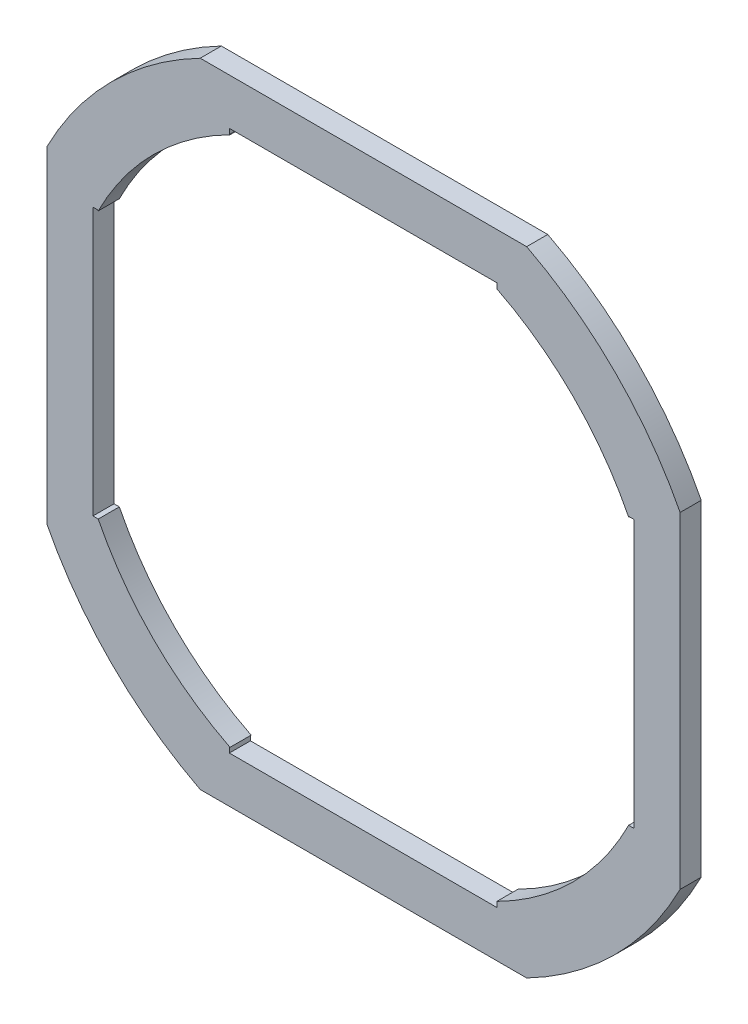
ISO-10303-21;
HEADER;
FILE_DESCRIPTION(('STEP AP214'),'2;1');
FILE_NAME('part.step','',(''),(''),'','','');
FILE_SCHEMA(('AUTOMOTIVE_DESIGN { 1 0 10303 214 1 1 1 1 }'));
ENDSEC;
DATA;
#1=APPLICATION_CONTEXT('core data for automotive mechanical design processes');
#2=APPLICATION_PROTOCOL_DEFINITION('international standard','automotive_design',2000,#1);
#3=PRODUCT_CONTEXT('',#1,'mechanical');
#4=PRODUCT('Part','Part','',(#3));
#5=PRODUCT_RELATED_PRODUCT_CATEGORY('part','',(#4));
#6=PRODUCT_DEFINITION_FORMATION('','',#4);
#7=PRODUCT_DEFINITION_CONTEXT('part definition',#1,'design');
#8=PRODUCT_DEFINITION('design','',#6,#7);
#9=PRODUCT_DEFINITION_SHAPE('','',#8);
#10=(LENGTH_UNIT() NAMED_UNIT(*) SI_UNIT(.MILLI.,.METRE.));
#11=(NAMED_UNIT(*) PLANE_ANGLE_UNIT() SI_UNIT($,.RADIAN.));
#12=(NAMED_UNIT(*) SI_UNIT($,.STERADIAN.) SOLID_ANGLE_UNIT());
#13=UNCERTAINTY_MEASURE_WITH_UNIT(LENGTH_MEASURE(1.E-05),#10,'distance_accuracy_value','');
#14=(GEOMETRIC_REPRESENTATION_CONTEXT(3) GLOBAL_UNCERTAINTY_ASSIGNED_CONTEXT((#13)) GLOBAL_UNIT_ASSIGNED_CONTEXT((#10,
#11,#12)) REPRESENTATION_CONTEXT('',''));
#15=CARTESIAN_POINT('',(0.,0.,0.));
#16=DIRECTION('',(0.,0.,1.));
#17=DIRECTION('',(1.,0.,0.));
#18=AXIS2_PLACEMENT_3D('',#15,#16,#17);
#19=CARTESIAN_POINT('',(0.,0.,-0.8));
#20=DIRECTION('',(0.,0.,-1.));
#21=DIRECTION('',(-1.,0.,0.));
#22=AXIS2_PLACEMENT_3D('',#19,#20,#21);
#23=PLANE('',#22);
#24=DIRECTION('',(1.,0.,0.));
#25=VECTOR('',#24,1.);
#26=CARTESIAN_POINT('',(-5.081068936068,10.05,-0.8));
#27=LINE('',#26,#25);
#28=CARTESIAN_POINT('',(-5.081068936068,10.05,-0.8));
#29=VERTEX_POINT('',#28);
#30=CARTESIAN_POINT('',(-5.05568986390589,10.05,-0.8));
#31=VERTEX_POINT('',#30);
#32=EDGE_CURVE('E181',#29,#31,#27,.T.);
#33=ORIENTED_EDGE('',*,*,#32,.T.);
#34=CARTESIAN_POINT('',(0.,0.,-0.8));
#35=DIRECTION('',(0.,0.,1.));
#36=DIRECTION('',(1.,0.,0.));
#37=AXIS2_PLACEMENT_3D('',#34,#35,#36);
#38=CIRCLE('',#37,11.25);
#39=CARTESIAN_POINT('',(-10.05,5.05568986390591,-0.8));
#40=VERTEX_POINT('',#39);
#41=EDGE_CURVE('E307',#31,#40,#38,.T.);
#42=ORIENTED_EDGE('',*,*,#41,.T.);
#43=DIRECTION('',(0.,1.,0.));
#44=VECTOR('',#43,1.);
#45=CARTESIAN_POINT('',(-10.05,0.,-0.8));
#46=LINE('',#45,#44);
#47=CARTESIAN_POINT('',(-10.05,5.081068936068,-0.8));
#48=VERTEX_POINT('',#47);
#49=EDGE_CURVE('E161',#40,#48,#46,.T.);
#50=ORIENTED_EDGE('',*,*,#49,.T.);
#51=DIRECTION('',(1.,0.,0.));
#52=VECTOR('',#51,1.);
#53=CARTESIAN_POINT('',(-10.25,5.081068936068,-0.8));
#54=LINE('',#53,#52);
#55=CARTESIAN_POINT('',(-10.25,5.081068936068,-0.8));
#56=VERTEX_POINT('',#55);
#57=EDGE_CURVE('E170',#56,#48,#54,.T.);
#58=ORIENTED_EDGE('',*,*,#57,.F.);
#59=DIRECTION('',(0.,1.,0.));
#60=VECTOR('',#59,1.);
#61=CARTESIAN_POINT('',(-10.25,-5.055689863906,-0.8));
#62=LINE('',#61,#60);
#63=CARTESIAN_POINT('',(-10.25,-5.055689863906,-0.8));
#64=VERTEX_POINT('',#63);
#65=EDGE_CURVE('E173',#64,#56,#62,.T.);
#66=ORIENTED_EDGE('',*,*,#65,.F.);
#67=DIRECTION('',(1.,0.,0.));
#68=VECTOR('',#67,1.);
#69=CARTESIAN_POINT('',(-10.05,-5.055689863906,-0.8));
#70=LINE('',#69,#68);
#71=CARTESIAN_POINT('',(-10.0499999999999,-5.05568986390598,-0.8));
#72=VERTEX_POINT('',#71);
#73=EDGE_CURVE('E254',#72,#64,#70,.F.);
#74=ORIENTED_EDGE('',*,*,#73,.F.);
#75=CARTESIAN_POINT('',(0.,0.,-0.8));
#76=DIRECTION('',(0.,0.,1.));
#77=DIRECTION('',(1.,0.,0.));
#78=AXIS2_PLACEMENT_3D('',#75,#76,#77);
#79=CIRCLE('',#78,11.25);
#80=CARTESIAN_POINT('',(-5.05568986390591,-10.05,-0.8));
#81=VERTEX_POINT('',#80);
#82=EDGE_CURVE('E316',#72,#81,#79,.T.);
#83=ORIENTED_EDGE('',*,*,#82,.T.);
#84=DIRECTION('',(1.,0.,0.));
#85=VECTOR('',#84,1.);
#86=CARTESIAN_POINT('',(-5.081068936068,-10.05,-0.8));
#87=LINE('',#86,#85);
#88=CARTESIAN_POINT('',(-5.081068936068,-10.05,-0.8));
#89=VERTEX_POINT('',#88);
#90=EDGE_CURVE('E249',#89,#81,#87,.T.);
#91=ORIENTED_EDGE('',*,*,#90,.F.);
#92=DIRECTION('',(0.,1.,0.));
#93=VECTOR('',#92,1.);
#94=CARTESIAN_POINT('',(-5.081068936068,-10.25,-0.8));
#95=LINE('',#94,#93);
#96=CARTESIAN_POINT('',(-5.081068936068,-10.25,-0.8));
#97=VERTEX_POINT('',#96);
#98=EDGE_CURVE('E243',#97,#89,#95,.T.);
#99=ORIENTED_EDGE('',*,*,#98,.F.);
#100=DIRECTION('',(1.,0.,0.));
#101=VECTOR('',#100,1.);
#102=CARTESIAN_POINT('',(5.055689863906,-10.25,-0.8));
#103=LINE('',#102,#101);
#104=CARTESIAN_POINT('',(5.055689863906,-10.25,-0.8));
#105=VERTEX_POINT('',#104);
#106=EDGE_CURVE('E237',#105,#97,#103,.F.);
#107=ORIENTED_EDGE('',*,*,#106,.F.);
#108=DIRECTION('',(0.,1.,0.));
#109=VECTOR('',#108,1.);
#110=CARTESIAN_POINT('',(5.055689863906,-10.05,-0.8));
#111=LINE('',#110,#109);
#112=CARTESIAN_POINT('',(5.05568986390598,-10.0499999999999,-0.8));
#113=VERTEX_POINT('',#112);
#114=EDGE_CURVE('E230',#113,#105,#111,.F.);
#115=ORIENTED_EDGE('',*,*,#114,.F.);
#116=CARTESIAN_POINT('',(0.,0.,-0.8));
#117=DIRECTION('',(0.,0.,1.));
#118=DIRECTION('',(1.,0.,0.));
#119=AXIS2_PLACEMENT_3D('',#116,#117,#118);
#120=CIRCLE('',#119,11.25);
#121=CARTESIAN_POINT('',(10.05,-5.055689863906,-0.8));
#122=VERTEX_POINT('',#121);
#123=EDGE_CURVE('E313',#113,#122,#120,.T.);
#124=ORIENTED_EDGE('',*,*,#123,.T.);
#125=DIRECTION('',(1.,0.,0.));
#126=VECTOR('',#125,1.);
#127=CARTESIAN_POINT('',(10.05,-5.055689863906,-0.8));
#128=LINE('',#127,#126);
#129=CARTESIAN_POINT('',(10.25,-5.055689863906,-0.8));
#130=VERTEX_POINT('',#129);
#131=EDGE_CURVE('E224',#122,#130,#128,.T.);
#132=ORIENTED_EDGE('',*,*,#131,.T.);
#133=DIRECTION('',(0.,1.,0.));
#134=VECTOR('',#133,1.);
#135=CARTESIAN_POINT('',(10.25,-5.055689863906,-0.8));
#136=LINE('',#135,#134);
#137=CARTESIAN_POINT('',(10.25,5.081068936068,-0.8));
#138=VERTEX_POINT('',#137);
#139=EDGE_CURVE('E218',#130,#138,#136,.T.);
#140=ORIENTED_EDGE('',*,*,#139,.T.);
#141=DIRECTION('',(1.,0.,0.));
#142=VECTOR('',#141,1.);
#143=CARTESIAN_POINT('',(10.25,5.081068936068,-0.8));
#144=LINE('',#143,#142);
#145=CARTESIAN_POINT('',(10.05,5.081068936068,-0.8));
#146=VERTEX_POINT('',#145);
#147=EDGE_CURVE('E212',#138,#146,#144,.F.);
#148=ORIENTED_EDGE('',*,*,#147,.T.);
#149=DIRECTION('',(0.,1.,0.));
#150=VECTOR('',#149,1.);
#151=CARTESIAN_POINT('',(10.05,5.081068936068,-0.8));
#152=LINE('',#151,#150);
#153=CARTESIAN_POINT('',(10.05,5.05568986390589,-0.8));
#154=VERTEX_POINT('',#153);
#155=EDGE_CURVE('E205',#146,#154,#152,.F.);
#156=ORIENTED_EDGE('',*,*,#155,.T.);
#157=CARTESIAN_POINT('',(0.,0.,-0.8));
#158=DIRECTION('',(0.,0.,1.));
#159=DIRECTION('',(1.,0.,0.));
#160=AXIS2_PLACEMENT_3D('',#157,#158,#159);
#161=CIRCLE('',#160,11.25);
#162=CARTESIAN_POINT('',(5.055689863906,10.05,-0.8));
#163=VERTEX_POINT('',#162);
#164=EDGE_CURVE('E208',#154,#163,#161,.T.);
#165=ORIENTED_EDGE('',*,*,#164,.T.);
#166=DIRECTION('',(0.,1.,0.));
#167=VECTOR('',#166,1.);
#168=CARTESIAN_POINT('',(5.055689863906,10.05,-0.8));
#169=LINE('',#168,#167);
#170=CARTESIAN_POINT('',(5.055689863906,10.25,-0.8));
#171=VERTEX_POINT('',#170);
#172=EDGE_CURVE('E199',#163,#171,#169,.T.);
#173=ORIENTED_EDGE('',*,*,#172,.T.);
#174=DIRECTION('',(1.,0.,0.));
#175=VECTOR('',#174,1.);
#176=CARTESIAN_POINT('',(5.055689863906,10.25,-0.8));
#177=LINE('',#176,#175);
#178=CARTESIAN_POINT('',(-5.081068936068,10.25,-0.8));
#179=VERTEX_POINT('',#178);
#180=EDGE_CURVE('E193',#171,#179,#177,.F.);
#181=ORIENTED_EDGE('',*,*,#180,.T.);
#182=DIRECTION('',(0.,1.,0.));
#183=VECTOR('',#182,1.);
#184=CARTESIAN_POINT('',(-5.081068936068,10.25,-0.8));
#185=LINE('',#184,#183);
#186=EDGE_CURVE('E187',#179,#29,#185,.F.);
#187=ORIENTED_EDGE('',*,*,#186,.T.);
#188=EDGE_LOOP('',(#33,#42,#50,#58,#66,#74,#83,#91,#99,#107,#115,#124,#132,#140,#148,#156,#165,
#173,#181,#187));
#189=FACE_BOUND('',#188,.T.);
#190=DIRECTION('',(0.,1.,0.));
#191=VECTOR('',#190,1.);
#192=CARTESIAN_POINT('',(-12.,-6.184658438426,-0.8));
#193=LINE('',#192,#191);
#194=CARTESIAN_POINT('',(-12.,-6.18465843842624,-0.8));
#195=VERTEX_POINT('',#194);
#196=CARTESIAN_POINT('',(-12.0000000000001,6.18465843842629,-0.8));
#197=VERTEX_POINT('',#196);
#198=EDGE_CURVE('E268',#195,#197,#193,.T.);
#199=ORIENTED_EDGE('',*,*,#198,.T.);
#200=CARTESIAN_POINT('',(0.,0.,-0.8));
#201=DIRECTION('',(0.,0.,-1.));
#202=DIRECTION('',(-1.,0.,0.));
#203=AXIS2_PLACEMENT_3D('',#200,#201,#202);
#204=CIRCLE('',#203,13.5);
#205=CARTESIAN_POINT('',(-6.18465843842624,12.,-0.8));
#206=VERTEX_POINT('',#205);
#207=EDGE_CURVE('E270',#206,#197,#204,.F.);
#208=ORIENTED_EDGE('',*,*,#207,.F.);
#209=DIRECTION('',(1.,0.,0.));
#210=VECTOR('',#209,1.);
#211=CARTESIAN_POINT('',(-7.,12.,-0.8));
#212=LINE('',#211,#210);
#213=CARTESIAN_POINT('',(6.18465843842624,12.,-0.8));
#214=VERTEX_POINT('',#213);
#215=EDGE_CURVE('E157',#206,#214,#212,.T.);
#216=ORIENTED_EDGE('',*,*,#215,.T.);
#217=CARTESIAN_POINT('',(0.,0.,-0.8));
#218=DIRECTION('',(0.,0.,-1.));
#219=DIRECTION('',(-1.,0.,0.));
#220=AXIS2_PLACEMENT_3D('',#217,#218,#219);
#221=CIRCLE('',#220,13.5);
#222=CARTESIAN_POINT('',(12.,6.18465843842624,-0.8));
#223=VERTEX_POINT('',#222);
#224=EDGE_CURVE('E19',#223,#214,#221,.F.);
#225=ORIENTED_EDGE('',*,*,#224,.F.);
#226=DIRECTION('',(0.,1.,0.));
#227=VECTOR('',#226,1.);
#228=CARTESIAN_POINT('',(12.,7.,-0.8));
#229=LINE('',#228,#227);
#230=CARTESIAN_POINT('',(12.0000000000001,-6.18465843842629,-0.8));
#231=VERTEX_POINT('',#230);
#232=EDGE_CURVE('E141',#223,#231,#229,.F.);
#233=ORIENTED_EDGE('',*,*,#232,.T.);
#234=CARTESIAN_POINT('',(0.,0.,-0.8));
#235=DIRECTION('',(0.,0.,-1.));
#236=DIRECTION('',(-1.,0.,0.));
#237=AXIS2_PLACEMENT_3D('',#234,#235,#236);
#238=CIRCLE('',#237,13.5);
#239=CARTESIAN_POINT('',(6.18465843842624,-12.,-0.8));
#240=VERTEX_POINT('',#239);
#241=EDGE_CURVE('E166',#240,#231,#238,.F.);
#242=ORIENTED_EDGE('',*,*,#241,.F.);
#243=DIRECTION('',(1.,0.,0.));
#244=VECTOR('',#243,1.);
#245=CARTESIAN_POINT('',(7.,-12.,-0.8));
#246=LINE('',#245,#244);
#247=CARTESIAN_POINT('',(-6.18465843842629,-12.0000000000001,-0.8));
#248=VERTEX_POINT('',#247);
#249=EDGE_CURVE('E272',#240,#248,#246,.F.);
#250=ORIENTED_EDGE('',*,*,#249,.T.);
#251=CARTESIAN_POINT('',(0.,0.,-0.8));
#252=DIRECTION('',(0.,0.,-1.));
#253=DIRECTION('',(-1.,0.,0.));
#254=AXIS2_PLACEMENT_3D('',#251,#252,#253);
#255=CIRCLE('',#254,13.5);
#256=EDGE_CURVE('E320',#195,#248,#255,.F.);
#257=ORIENTED_EDGE('',*,*,#256,.F.);
#258=EDGE_LOOP('',(#199,#208,#216,#225,#233,#242,#250,#257));
#259=FACE_BOUND('',#258,.T.);
#260=ADVANCED_FACE('F16',(#189,#259),#23,.T.);
#261=CARTESIAN_POINT('',(0.,0.,0.));
#262=DIRECTION('',(0.,0.,-1.));
#263=DIRECTION('',(-1.,0.,0.));
#264=AXIS2_PLACEMENT_3D('',#261,#262,#263);
#265=CYLINDRICAL_SURFACE('',#264,13.5);
#266=DIRECTION('',(0.,0.,1.));
#267=VECTOR('',#266,1.);
#268=CARTESIAN_POINT('',(12.,6.184658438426,0.));
#269=LINE('',#268,#267);
#270=CARTESIAN_POINT('',(12.,6.18465843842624,0.));
#271=VERTEX_POINT('',#270);
#272=EDGE_CURVE('E146',#271,#223,#269,.F.);
#273=ORIENTED_EDGE('',*,*,#272,.T.);
#274=ORIENTED_EDGE('',*,*,#224,.T.);
#275=DIRECTION('',(0.,0.,-1.));
#276=VECTOR('',#275,1.);
#277=CARTESIAN_POINT('',(6.184658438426,12.,0.));
#278=LINE('',#277,#276);
#279=CARTESIAN_POINT('',(6.18465843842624,12.,0.));
#280=VERTEX_POINT('',#279);
#281=EDGE_CURVE('E266',#214,#280,#278,.F.);
#282=ORIENTED_EDGE('',*,*,#281,.T.);
#283=CARTESIAN_POINT('',(0.,0.,0.));
#284=DIRECTION('',(0.,0.,-1.));
#285=DIRECTION('',(-1.,0.,0.));
#286=AXIS2_PLACEMENT_3D('',#283,#284,#285);
#287=CIRCLE('',#286,13.5);
#288=EDGE_CURVE('E164',#280,#271,#287,.T.);
#289=ORIENTED_EDGE('',*,*,#288,.T.);
#290=EDGE_LOOP('',(#273,#274,#282,#289));
#291=FACE_BOUND('',#290,.T.);
#292=ADVANCED_FACE('F163',(#291),#265,.T.);
#293=CARTESIAN_POINT('',(12.,7.,0.));
#294=DIRECTION('',(-1.,0.,0.));
#295=DIRECTION('',(0.,0.,1.));
#296=AXIS2_PLACEMENT_3D('',#293,#294,#295);
#297=PLANE('',#296);
#298=DIRECTION('',(0.,1.,0.));
#299=VECTOR('',#298,1.);
#300=CARTESIAN_POINT('',(12.,0.,0.));
#301=LINE('',#300,#299);
#302=CARTESIAN_POINT('',(12.0000000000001,-6.18465843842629,0.));
#303=VERTEX_POINT('',#302);
#304=EDGE_CURVE('E305',#271,#303,#301,.F.);
#305=ORIENTED_EDGE('',*,*,#304,.T.);
#306=DIRECTION('',(0.,0.,-1.));
#307=VECTOR('',#306,1.);
#308=CARTESIAN_POINT('',(12.0000000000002,-6.1846584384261,0.));
#309=LINE('',#308,#307);
#310=EDGE_CURVE('E148',#231,#303,#309,.F.);
#311=ORIENTED_EDGE('',*,*,#310,.F.);
#312=ORIENTED_EDGE('',*,*,#232,.F.);
#313=ORIENTED_EDGE('',*,*,#272,.F.);
#314=EDGE_LOOP('',(#305,#311,#312,#313));
#315=FACE_BOUND('',#314,.T.);
#316=ADVANCED_FACE('F144',(#315),#297,.F.);
#317=CARTESIAN_POINT('',(0.,0.,0.));
#318=DIRECTION('',(0.,0.,-1.));
#319=DIRECTION('',(-1.,0.,0.));
#320=AXIS2_PLACEMENT_3D('',#317,#318,#319);
#321=CYLINDRICAL_SURFACE('',#320,13.5);
#322=DIRECTION('',(0.,0.,1.));
#323=VECTOR('',#322,1.);
#324=CARTESIAN_POINT('',(6.184658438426,-12.,0.));
#325=LINE('',#324,#323);
#326=CARTESIAN_POINT('',(6.18465843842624,-12.,0.));
#327=VERTEX_POINT('',#326);
#328=EDGE_CURVE('E273',#327,#240,#325,.F.);
#329=ORIENTED_EDGE('',*,*,#328,.T.);
#330=ORIENTED_EDGE('',*,*,#241,.T.);
#331=ORIENTED_EDGE('',*,*,#310,.T.);
#332=CARTESIAN_POINT('',(0.,0.,0.));
#333=DIRECTION('',(0.,0.,-1.));
#334=DIRECTION('',(-1.,0.,0.));
#335=AXIS2_PLACEMENT_3D('',#332,#333,#334);
#336=CIRCLE('',#335,13.5);
#337=EDGE_CURVE('E302',#303,#327,#336,.T.);
#338=ORIENTED_EDGE('',*,*,#337,.T.);
#339=EDGE_LOOP('',(#329,#330,#331,#338));
#340=FACE_BOUND('',#339,.T.);
#341=ADVANCED_FACE('F325',(#340),#321,.T.);
#342=CARTESIAN_POINT('',(7.,-12.,0.));
#343=DIRECTION('',(0.,1.,0.));
#344=DIRECTION('',(0.,0.,1.));
#345=AXIS2_PLACEMENT_3D('',#342,#343,#344);
#346=PLANE('',#345);
#347=DIRECTION('',(-1.,0.,0.));
#348=VECTOR('',#347,1.);
#349=CARTESIAN_POINT('',(0.,-12.,0.));
#350=LINE('',#349,#348);
#351=CARTESIAN_POINT('',(-6.18465843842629,-12.0000000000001,0.));
#352=VERTEX_POINT('',#351);
#353=EDGE_CURVE('E301',#327,#352,#350,.T.);
#354=ORIENTED_EDGE('',*,*,#353,.T.);
#355=DIRECTION('',(0.,0.,-1.));
#356=VECTOR('',#355,1.);
#357=CARTESIAN_POINT('',(-6.1846584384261,-12.0000000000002,0.));
#358=LINE('',#357,#356);
#359=EDGE_CURVE('E322',#248,#352,#358,.F.);
#360=ORIENTED_EDGE('',*,*,#359,.F.);
#361=ORIENTED_EDGE('',*,*,#249,.F.);
#362=ORIENTED_EDGE('',*,*,#328,.F.);
#363=EDGE_LOOP('',(#354,#360,#361,#362));
#364=FACE_BOUND('',#363,.T.);
#365=ADVANCED_FACE('F335',(#364),#346,.F.);
#366=CARTESIAN_POINT('',(0.,0.,0.));
#367=DIRECTION('',(0.,0.,-1.));
#368=DIRECTION('',(-1.,0.,0.));
#369=AXIS2_PLACEMENT_3D('',#366,#367,#368);
#370=CYLINDRICAL_SURFACE('',#369,13.5);
#371=DIRECTION('',(0.,0.,-1.));
#372=VECTOR('',#371,1.);
#373=CARTESIAN_POINT('',(-12.,-6.184658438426,0.));
#374=LINE('',#373,#372);
#375=CARTESIAN_POINT('',(-12.,-6.18465843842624,0.));
#376=VERTEX_POINT('',#375);
#377=EDGE_CURVE('E271',#376,#195,#374,.T.);
#378=ORIENTED_EDGE('',*,*,#377,.T.);
#379=ORIENTED_EDGE('',*,*,#256,.T.);
#380=ORIENTED_EDGE('',*,*,#359,.T.);
#381=CARTESIAN_POINT('',(0.,0.,0.));
#382=DIRECTION('',(0.,0.,-1.));
#383=DIRECTION('',(-1.,0.,0.));
#384=AXIS2_PLACEMENT_3D('',#381,#382,#383);
#385=CIRCLE('',#384,13.5);
#386=EDGE_CURVE('E298',#352,#376,#385,.T.);
#387=ORIENTED_EDGE('',*,*,#386,.T.);
#388=EDGE_LOOP('',(#378,#379,#380,#387));
#389=FACE_BOUND('',#388,.T.);
#390=ADVANCED_FACE('F332',(#389),#370,.T.);
#391=CARTESIAN_POINT('',(-12.,-6.184658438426,0.));
#392=DIRECTION('',(1.,0.,0.));
#393=DIRECTION('',(0.,0.,-1.));
#394=AXIS2_PLACEMENT_3D('',#391,#392,#393);
#395=PLANE('',#394);
#396=ORIENTED_EDGE('',*,*,#377,.F.);
#397=DIRECTION('',(0.,1.,0.));
#398=VECTOR('',#397,1.);
#399=CARTESIAN_POINT('',(-12.,0.,0.));
#400=LINE('',#399,#398);
#401=CARTESIAN_POINT('',(-12.0000000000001,6.18465843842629,0.));
#402=VERTEX_POINT('',#401);
#403=EDGE_CURVE('E297',#376,#402,#400,.T.);
#404=ORIENTED_EDGE('',*,*,#403,.T.);
#405=DIRECTION('',(0.,0.,-1.));
#406=VECTOR('',#405,1.);
#407=CARTESIAN_POINT('',(-12.0000000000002,6.1846584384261,0.));
#408=LINE('',#407,#406);
#409=EDGE_CURVE('E267',#197,#402,#408,.F.);
#410=ORIENTED_EDGE('',*,*,#409,.F.);
#411=ORIENTED_EDGE('',*,*,#198,.F.);
#412=EDGE_LOOP('',(#396,#404,#410,#411));
#413=FACE_BOUND('',#412,.T.);
#414=ADVANCED_FACE('F721',(#413),#395,.F.);
#415=CARTESIAN_POINT('',(0.,0.,0.));
#416=DIRECTION('',(0.,0.,-1.));
#417=DIRECTION('',(-1.,0.,0.));
#418=AXIS2_PLACEMENT_3D('',#415,#416,#417);
#419=CYLINDRICAL_SURFACE('',#418,13.5);
#420=ORIENTED_EDGE('',*,*,#409,.T.);
#421=CARTESIAN_POINT('',(0.,0.,0.));
#422=DIRECTION('',(0.,0.,-1.));
#423=DIRECTION('',(-1.,0.,0.));
#424=AXIS2_PLACEMENT_3D('',#421,#422,#423);
#425=CIRCLE('',#424,13.5);
#426=CARTESIAN_POINT('',(-6.18465843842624,12.,0.));
#427=VERTEX_POINT('',#426);
#428=EDGE_CURVE('E293',#402,#427,#425,.T.);
#429=ORIENTED_EDGE('',*,*,#428,.T.);
#430=DIRECTION('',(0.,0.,-1.));
#431=VECTOR('',#430,1.);
#432=CARTESIAN_POINT('',(-6.184658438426,12.,0.));
#433=LINE('',#432,#431);
#434=EDGE_CURVE('E174',#427,#206,#433,.T.);
#435=ORIENTED_EDGE('',*,*,#434,.T.);
#436=ORIENTED_EDGE('',*,*,#207,.T.);
#437=EDGE_LOOP('',(#420,#429,#435,#436));
#438=FACE_BOUND('',#437,.T.);
#439=ADVANCED_FACE('F713',(#438),#419,.T.);
#440=CARTESIAN_POINT('',(-7.,12.,0.));
#441=DIRECTION('',(0.,-1.,0.));
#442=DIRECTION('',(0.,0.,-1.));
#443=AXIS2_PLACEMENT_3D('',#440,#441,#442);
#444=PLANE('',#443);
#445=DIRECTION('',(-1.,0.,0.));
#446=VECTOR('',#445,1.);
#447=CARTESIAN_POINT('',(0.,12.,0.));
#448=LINE('',#447,#446);
#449=EDGE_CURVE('E296',#427,#280,#448,.F.);
#450=ORIENTED_EDGE('',*,*,#449,.T.);
#451=ORIENTED_EDGE('',*,*,#281,.F.);
#452=ORIENTED_EDGE('',*,*,#215,.F.);
#453=ORIENTED_EDGE('',*,*,#434,.F.);
#454=EDGE_LOOP('',(#450,#451,#452,#453));
#455=FACE_BOUND('',#454,.T.);
#456=ADVANCED_FACE('F706',(#455),#444,.F.);
#457=CARTESIAN_POINT('',(-10.25,5.081068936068,0.));
#458=DIRECTION('',(0.,-1.,0.));
#459=DIRECTION('',(0.,0.,-1.));
#460=AXIS2_PLACEMENT_3D('',#457,#458,#459);
#461=PLANE('',#460);
#462=ORIENTED_EDGE('',*,*,#57,.T.);
#463=DIRECTION('',(0.,0.,1.));
#464=VECTOR('',#463,1.);
#465=CARTESIAN_POINT('',(-10.05,5.081068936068,0.));
#466=LINE('',#465,#464);
#467=CARTESIAN_POINT('',(-10.05,5.081068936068,0.));
#468=VERTEX_POINT('',#467);
#469=EDGE_CURVE('E310',#468,#48,#466,.F.);
#470=ORIENTED_EDGE('',*,*,#469,.F.);
#471=DIRECTION('',(-1.,0.,0.));
#472=VECTOR('',#471,1.);
#473=CARTESIAN_POINT('',(0.,5.081068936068,0.));
#474=LINE('',#473,#472);
#475=CARTESIAN_POINT('',(-10.25,5.081068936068,0.));
#476=VERTEX_POINT('',#475);
#477=EDGE_CURVE('E353',#468,#476,#474,.T.);
#478=ORIENTED_EDGE('',*,*,#477,.T.);
#479=DIRECTION('',(0.,0.,-1.));
#480=VECTOR('',#479,1.);
#481=CARTESIAN_POINT('',(-10.25,5.081068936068,0.));
#482=LINE('',#481,#480);
#483=EDGE_CURVE('E258',#56,#476,#482,.F.);
#484=ORIENTED_EDGE('',*,*,#483,.F.);
#485=EDGE_LOOP('',(#462,#470,#478,#484));
#486=FACE_BOUND('',#485,.T.);
#487=ADVANCED_FACE('F540',(#486),#461,.T.);
#488=CARTESIAN_POINT('',(-10.25,-5.055689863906,0.));
#489=DIRECTION('',(1.,0.,0.));
#490=DIRECTION('',(0.,0.,-1.));
#491=AXIS2_PLACEMENT_3D('',#488,#489,#490);
#492=PLANE('',#491);
#493=ORIENTED_EDGE('',*,*,#65,.T.);
#494=ORIENTED_EDGE('',*,*,#483,.T.);
#495=DIRECTION('',(0.,1.,0.));
#496=VECTOR('',#495,1.);
#497=CARTESIAN_POINT('',(-10.25,0.,0.));
#498=LINE('',#497,#496);
#499=CARTESIAN_POINT('',(-10.25,-5.055689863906,0.));
#500=VERTEX_POINT('',#499);
#501=EDGE_CURVE('E350',#476,#500,#498,.F.);
#502=ORIENTED_EDGE('',*,*,#501,.T.);
#503=DIRECTION('',(0.,0.,1.));
#504=VECTOR('',#503,1.);
#505=CARTESIAN_POINT('',(-10.25,-5.055689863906,0.));
#506=LINE('',#505,#504);
#507=EDGE_CURVE('E257',#64,#500,#506,.T.);
#508=ORIENTED_EDGE('',*,*,#507,.F.);
#509=EDGE_LOOP('',(#493,#494,#502,#508));
#510=FACE_BOUND('',#509,.T.);
#511=ADVANCED_FACE('F691',(#510),#492,.T.);
#512=CARTESIAN_POINT('',(-10.05,-5.055689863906,0.));
#513=DIRECTION('',(0.,1.,0.));
#514=DIRECTION('',(0.,0.,1.));
#515=AXIS2_PLACEMENT_3D('',#512,#513,#514);
#516=PLANE('',#515);
#517=ORIENTED_EDGE('',*,*,#73,.T.);
#518=ORIENTED_EDGE('',*,*,#507,.T.);
#519=DIRECTION('',(-1.,0.,0.));
#520=VECTOR('',#519,1.);
#521=CARTESIAN_POINT('',(0.,-5.055689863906,0.));
#522=LINE('',#521,#520);
#523=CARTESIAN_POINT('',(-10.0499999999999,-5.05568986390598,0.));
#524=VERTEX_POINT('',#523);
#525=EDGE_CURVE('E292',#500,#524,#522,.F.);
#526=ORIENTED_EDGE('',*,*,#525,.T.);
#527=DIRECTION('',(0.,0.,1.));
#528=VECTOR('',#527,1.);
#529=CARTESIAN_POINT('',(-10.0499999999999,-5.05568986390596,0.));
#530=LINE('',#529,#528);
#531=EDGE_CURVE('E251',#524,#72,#530,.F.);
#532=ORIENTED_EDGE('',*,*,#531,.T.);
#533=EDGE_LOOP('',(#517,#518,#526,#532));
#534=FACE_BOUND('',#533,.T.);
#535=ADVANCED_FACE('F683',(#534),#516,.T.);
#536=CARTESIAN_POINT('',(0.,0.,0.));
#537=DIRECTION('',(0.,0.,1.));
#538=DIRECTION('',(1.,0.,0.));
#539=AXIS2_PLACEMENT_3D('',#536,#537,#538);
#540=CYLINDRICAL_SURFACE('',#539,11.25);
#541=CARTESIAN_POINT('',(0.,0.,0.));
#542=DIRECTION('',(0.,0.,1.));
#543=DIRECTION('',(1.,0.,0.));
#544=AXIS2_PLACEMENT_3D('',#541,#542,#543);
#545=CIRCLE('',#544,11.25);
#546=CARTESIAN_POINT('',(-5.05568986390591,-10.05,0.));
#547=VERTEX_POINT('',#546);
#548=EDGE_CURVE('E288',#524,#547,#545,.T.);
#549=ORIENTED_EDGE('',*,*,#548,.T.);
#550=DIRECTION('',(0.,0.,-1.));
#551=VECTOR('',#550,1.);
#552=CARTESIAN_POINT('',(-5.055689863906,-10.05,0.));
#553=LINE('',#552,#551);
#554=EDGE_CURVE('E246',#81,#547,#553,.F.);
#555=ORIENTED_EDGE('',*,*,#554,.F.);
#556=ORIENTED_EDGE('',*,*,#82,.F.);
#557=ORIENTED_EDGE('',*,*,#531,.F.);
#558=EDGE_LOOP('',(#549,#555,#556,#557));
#559=FACE_BOUND('',#558,.T.);
#560=ADVANCED_FACE('F675',(#559),#540,.F.);
#561=CARTESIAN_POINT('',(-5.081068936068,-10.05,0.));
#562=DIRECTION('',(0.,-1.,0.));
#563=DIRECTION('',(0.,0.,-1.));
#564=AXIS2_PLACEMENT_3D('',#561,#562,#563);
#565=PLANE('',#564);
#566=ORIENTED_EDGE('',*,*,#90,.T.);
#567=ORIENTED_EDGE('',*,*,#554,.T.);
#568=DIRECTION('',(-1.,0.,0.));
#569=VECTOR('',#568,1.);
#570=CARTESIAN_POINT('',(0.,-10.05,0.));
#571=LINE('',#570,#569);
#572=CARTESIAN_POINT('',(-5.081068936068,-10.05,0.));
#573=VERTEX_POINT('',#572);
#574=EDGE_CURVE('E291',#547,#573,#571,.T.);
#575=ORIENTED_EDGE('',*,*,#574,.T.);
#576=DIRECTION('',(0.,0.,-1.));
#577=VECTOR('',#576,1.);
#578=CARTESIAN_POINT('',(-5.081068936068,-10.05,0.));
#579=LINE('',#578,#577);
#580=EDGE_CURVE('E240',#89,#573,#579,.F.);
#581=ORIENTED_EDGE('',*,*,#580,.F.);
#582=EDGE_LOOP('',(#566,#567,#575,#581));
#583=FACE_BOUND('',#582,.T.);
#584=ADVANCED_FACE('F667',(#583),#565,.T.);
#585=CARTESIAN_POINT('',(-5.081068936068,-10.25,0.));
#586=DIRECTION('',(1.,0.,0.));
#587=DIRECTION('',(0.,0.,-1.));
#588=AXIS2_PLACEMENT_3D('',#585,#586,#587);
#589=PLANE('',#588);
#590=ORIENTED_EDGE('',*,*,#98,.T.);
#591=ORIENTED_EDGE('',*,*,#580,.T.);
#592=DIRECTION('',(0.,1.,0.));
#593=VECTOR('',#592,1.);
#594=CARTESIAN_POINT('',(-5.081068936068,0.,0.));
#595=LINE('',#594,#593);
#596=CARTESIAN_POINT('',(-5.081068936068,-10.25,0.));
#597=VERTEX_POINT('',#596);
#598=EDGE_CURVE('E367',#573,#597,#595,.F.);
#599=ORIENTED_EDGE('',*,*,#598,.T.);
#600=DIRECTION('',(0.,0.,1.));
#601=VECTOR('',#600,1.);
#602=CARTESIAN_POINT('',(-5.081068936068,-10.25,0.));
#603=LINE('',#602,#601);
#604=EDGE_CURVE('E234',#97,#597,#603,.T.);
#605=ORIENTED_EDGE('',*,*,#604,.F.);
#606=EDGE_LOOP('',(#590,#591,#599,#605));
#607=FACE_BOUND('',#606,.T.);
#608=ADVANCED_FACE('F659',(#607),#589,.T.);
#609=CARTESIAN_POINT('',(5.055689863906,-10.25,0.));
#610=DIRECTION('',(0.,1.,0.));
#611=DIRECTION('',(0.,0.,1.));
#612=AXIS2_PLACEMENT_3D('',#609,#610,#611);
#613=PLANE('',#612);
#614=ORIENTED_EDGE('',*,*,#106,.T.);
#615=ORIENTED_EDGE('',*,*,#604,.T.);
#616=DIRECTION('',(-1.,0.,0.));
#617=VECTOR('',#616,1.);
#618=CARTESIAN_POINT('',(0.,-10.25,0.));
#619=LINE('',#618,#617);
#620=CARTESIAN_POINT('',(5.055689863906,-10.25,0.));
#621=VERTEX_POINT('',#620);
#622=EDGE_CURVE('E370',#597,#621,#619,.F.);
#623=ORIENTED_EDGE('',*,*,#622,.T.);
#624=DIRECTION('',(0.,0.,1.));
#625=VECTOR('',#624,1.);
#626=CARTESIAN_POINT('',(5.055689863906,-10.25,0.));
#627=LINE('',#626,#625);
#628=EDGE_CURVE('E233',#105,#621,#627,.T.);
#629=ORIENTED_EDGE('',*,*,#628,.F.);
#630=EDGE_LOOP('',(#614,#615,#623,#629));
#631=FACE_BOUND('',#630,.T.);
#632=ADVANCED_FACE('F651',(#631),#613,.T.);
#633=CARTESIAN_POINT('',(5.055689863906,-10.05,0.));
#634=DIRECTION('',(-1.,0.,0.));
#635=DIRECTION('',(0.,0.,1.));
#636=AXIS2_PLACEMENT_3D('',#633,#634,#635);
#637=PLANE('',#636);
#638=ORIENTED_EDGE('',*,*,#114,.T.);
#639=ORIENTED_EDGE('',*,*,#628,.T.);
#640=DIRECTION('',(0.,1.,0.));
#641=VECTOR('',#640,1.);
#642=CARTESIAN_POINT('',(5.055689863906,0.,0.));
#643=LINE('',#642,#641);
#644=CARTESIAN_POINT('',(5.05568986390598,-10.0499999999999,0.));
#645=VERTEX_POINT('',#644);
#646=EDGE_CURVE('E287',#621,#645,#643,.T.);
#647=ORIENTED_EDGE('',*,*,#646,.T.);
#648=DIRECTION('',(0.,0.,1.));
#649=VECTOR('',#648,1.);
#650=CARTESIAN_POINT('',(5.05568986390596,-10.0499999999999,0.));
#651=LINE('',#650,#649);
#652=EDGE_CURVE('E315',#645,#113,#651,.F.);
#653=ORIENTED_EDGE('',*,*,#652,.T.);
#654=EDGE_LOOP('',(#638,#639,#647,#653));
#655=FACE_BOUND('',#654,.T.);
#656=ADVANCED_FACE('F643',(#655),#637,.T.);
#657=CARTESIAN_POINT('',(0.,0.,0.));
#658=DIRECTION('',(0.,0.,1.));
#659=DIRECTION('',(1.,0.,0.));
#660=AXIS2_PLACEMENT_3D('',#657,#658,#659);
#661=CYLINDRICAL_SURFACE('',#660,11.25);
#662=ORIENTED_EDGE('',*,*,#123,.F.);
#663=ORIENTED_EDGE('',*,*,#652,.F.);
#664=CARTESIAN_POINT('',(0.,0.,0.));
#665=DIRECTION('',(0.,0.,1.));
#666=DIRECTION('',(1.,0.,0.));
#667=AXIS2_PLACEMENT_3D('',#664,#665,#666);
#668=CIRCLE('',#667,11.25);
#669=CARTESIAN_POINT('',(10.05,-5.055689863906,0.));
#670=VERTEX_POINT('',#669);
#671=EDGE_CURVE('E283',#645,#670,#668,.T.);
#672=ORIENTED_EDGE('',*,*,#671,.T.);
#673=DIRECTION('',(0.,0.,-1.));
#674=VECTOR('',#673,1.);
#675=CARTESIAN_POINT('',(10.05,-5.055689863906,0.));
#676=LINE('',#675,#674);
#677=EDGE_CURVE('E227',#670,#122,#676,.T.);
#678=ORIENTED_EDGE('',*,*,#677,.T.);
#679=EDGE_LOOP('',(#662,#663,#672,#678));
#680=FACE_BOUND('',#679,.T.);
#681=ADVANCED_FACE('F635',(#680),#661,.F.);
#682=CARTESIAN_POINT('',(10.05,-5.055689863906,0.));
#683=DIRECTION('',(0.,-1.,0.));
#684=DIRECTION('',(0.,0.,-1.));
#685=AXIS2_PLACEMENT_3D('',#682,#683,#684);
#686=PLANE('',#685);
#687=DIRECTION('',(0.,0.,-1.));
#688=VECTOR('',#687,1.);
#689=CARTESIAN_POINT('',(10.25,-5.055689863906,0.));
#690=LINE('',#689,#688);
#691=CARTESIAN_POINT('',(10.25,-5.055689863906,0.));
#692=VERTEX_POINT('',#691);
#693=EDGE_CURVE('E221',#692,#130,#690,.T.);
#694=ORIENTED_EDGE('',*,*,#693,.T.);
#695=ORIENTED_EDGE('',*,*,#131,.F.);
#696=ORIENTED_EDGE('',*,*,#677,.F.);
#697=DIRECTION('',(-1.,0.,0.));
#698=VECTOR('',#697,1.);
#699=CARTESIAN_POINT('',(0.,-5.055689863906,0.));
#700=LINE('',#699,#698);
#701=EDGE_CURVE('E286',#670,#692,#700,.F.);
#702=ORIENTED_EDGE('',*,*,#701,.T.);
#703=EDGE_LOOP('',(#694,#695,#696,#702));
#704=FACE_BOUND('',#703,.T.);
#705=ADVANCED_FACE('F627',(#704),#686,.F.);
#706=CARTESIAN_POINT('',(10.25,-5.055689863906,0.));
#707=DIRECTION('',(1.,0.,0.));
#708=DIRECTION('',(0.,0.,-1.));
#709=AXIS2_PLACEMENT_3D('',#706,#707,#708);
#710=PLANE('',#709);
#711=DIRECTION('',(0.,0.,1.));
#712=VECTOR('',#711,1.);
#713=CARTESIAN_POINT('',(10.25,5.081068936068,0.));
#714=LINE('',#713,#712);
#715=CARTESIAN_POINT('',(10.25,5.081068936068,0.));
#716=VERTEX_POINT('',#715);
#717=EDGE_CURVE('E215',#716,#138,#714,.F.);
#718=ORIENTED_EDGE('',*,*,#717,.T.);
#719=ORIENTED_EDGE('',*,*,#139,.F.);
#720=ORIENTED_EDGE('',*,*,#693,.F.);
#721=DIRECTION('',(0.,1.,0.));
#722=VECTOR('',#721,1.);
#723=CARTESIAN_POINT('',(10.25,0.,0.));
#724=LINE('',#723,#722);
#725=EDGE_CURVE('E393',#692,#716,#724,.T.);
#726=ORIENTED_EDGE('',*,*,#725,.T.);
#727=EDGE_LOOP('',(#718,#719,#720,#726));
#728=FACE_BOUND('',#727,.T.);
#729=ADVANCED_FACE('F619',(#728),#710,.F.);
#730=CARTESIAN_POINT('',(10.25,5.081068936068,0.));
#731=DIRECTION('',(0.,1.,0.));
#732=DIRECTION('',(0.,0.,1.));
#733=AXIS2_PLACEMENT_3D('',#730,#731,#732);
#734=PLANE('',#733);
#735=DIRECTION('',(0.,0.,1.));
#736=VECTOR('',#735,1.);
#737=CARTESIAN_POINT('',(10.05,5.081068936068,0.));
#738=LINE('',#737,#736);
#739=CARTESIAN_POINT('',(10.05,5.081068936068,0.));
#740=VERTEX_POINT('',#739);
#741=EDGE_CURVE('E209',#740,#146,#738,.F.);
#742=ORIENTED_EDGE('',*,*,#741,.T.);
#743=ORIENTED_EDGE('',*,*,#147,.F.);
#744=ORIENTED_EDGE('',*,*,#717,.F.);
#745=DIRECTION('',(-1.,0.,0.));
#746=VECTOR('',#745,1.);
#747=CARTESIAN_POINT('',(0.,5.081068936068,0.));
#748=LINE('',#747,#746);
#749=EDGE_CURVE('E396',#716,#740,#748,.T.);
#750=ORIENTED_EDGE('',*,*,#749,.T.);
#751=EDGE_LOOP('',(#742,#743,#744,#750));
#752=FACE_BOUND('',#751,.T.);
#753=ADVANCED_FACE('F611',(#752),#734,.F.);
#754=CARTESIAN_POINT('',(10.05,5.081068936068,0.));
#755=DIRECTION('',(-1.,0.,0.));
#756=DIRECTION('',(0.,0.,1.));
#757=AXIS2_PLACEMENT_3D('',#754,#755,#756);
#758=PLANE('',#757);
#759=DIRECTION('',(0.,0.,1.));
#760=VECTOR('',#759,1.);
#761=CARTESIAN_POINT('',(10.0499999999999,5.05568986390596,0.));
#762=LINE('',#761,#760);
#763=CARTESIAN_POINT('',(10.05,5.05568986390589,0.));
#764=VERTEX_POINT('',#763);
#765=EDGE_CURVE('E312',#764,#154,#762,.F.);
#766=ORIENTED_EDGE('',*,*,#765,.T.);
#767=ORIENTED_EDGE('',*,*,#155,.F.);
#768=ORIENTED_EDGE('',*,*,#741,.F.);
#769=DIRECTION('',(0.,1.,0.));
#770=VECTOR('',#769,1.);
#771=CARTESIAN_POINT('',(10.05,0.,0.));
#772=LINE('',#771,#770);
#773=EDGE_CURVE('E282',#740,#764,#772,.F.);
#774=ORIENTED_EDGE('',*,*,#773,.T.);
#775=EDGE_LOOP('',(#766,#767,#768,#774));
#776=FACE_BOUND('',#775,.T.);
#777=ADVANCED_FACE('F603',(#776),#758,.F.);
#778=CARTESIAN_POINT('',(0.,0.,0.));
#779=DIRECTION('',(0.,0.,1.));
#780=DIRECTION('',(1.,0.,0.));
#781=AXIS2_PLACEMENT_3D('',#778,#779,#780);
#782=CYLINDRICAL_SURFACE('',#781,11.25);
#783=CARTESIAN_POINT('',(0.,0.,0.));
#784=DIRECTION('',(0.,0.,1.));
#785=DIRECTION('',(1.,0.,0.));
#786=AXIS2_PLACEMENT_3D('',#783,#784,#785);
#787=CIRCLE('',#786,11.25);
#788=CARTESIAN_POINT('',(5.055689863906,10.05,0.));
#789=VERTEX_POINT('',#788);
#790=EDGE_CURVE('E278',#764,#789,#787,.T.);
#791=ORIENTED_EDGE('',*,*,#790,.T.);
#792=DIRECTION('',(0.,0.,-1.));
#793=VECTOR('',#792,1.);
#794=CARTESIAN_POINT('',(5.055689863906,10.05,0.));
#795=LINE('',#794,#793);
#796=EDGE_CURVE('E202',#789,#163,#795,.T.);
#797=ORIENTED_EDGE('',*,*,#796,.T.);
#798=ORIENTED_EDGE('',*,*,#164,.F.);
#799=ORIENTED_EDGE('',*,*,#765,.F.);
#800=EDGE_LOOP('',(#791,#797,#798,#799));
#801=FACE_BOUND('',#800,.T.);
#802=ADVANCED_FACE('F595',(#801),#782,.F.);
#803=CARTESIAN_POINT('',(5.055689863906,10.05,0.));
#804=DIRECTION('',(1.,0.,0.));
#805=DIRECTION('',(0.,0.,-1.));
#806=AXIS2_PLACEMENT_3D('',#803,#804,#805);
#807=PLANE('',#806);
#808=DIRECTION('',(0.,0.,1.));
#809=VECTOR('',#808,1.);
#810=CARTESIAN_POINT('',(5.055689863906,10.25,0.));
#811=LINE('',#810,#809);
#812=CARTESIAN_POINT('',(5.055689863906,10.25,0.));
#813=VERTEX_POINT('',#812);
#814=EDGE_CURVE('E196',#813,#171,#811,.F.);
#815=ORIENTED_EDGE('',*,*,#814,.T.);
#816=ORIENTED_EDGE('',*,*,#172,.F.);
#817=ORIENTED_EDGE('',*,*,#796,.F.);
#818=DIRECTION('',(0.,1.,0.));
#819=VECTOR('',#818,1.);
#820=CARTESIAN_POINT('',(5.055689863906,0.,0.));
#821=LINE('',#820,#819);
#822=EDGE_CURVE('E281',#789,#813,#821,.T.);
#823=ORIENTED_EDGE('',*,*,#822,.T.);
#824=EDGE_LOOP('',(#815,#816,#817,#823));
#825=FACE_BOUND('',#824,.T.);
#826=ADVANCED_FACE('F588',(#825),#807,.F.);
#827=CARTESIAN_POINT('',(5.055689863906,10.25,0.));
#828=DIRECTION('',(0.,1.,0.));
#829=DIRECTION('',(0.,0.,1.));
#830=AXIS2_PLACEMENT_3D('',#827,#828,#829);
#831=PLANE('',#830);
#832=DIRECTION('',(0.,0.,1.));
#833=VECTOR('',#832,1.);
#834=CARTESIAN_POINT('',(-5.081068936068,10.25,0.));
#835=LINE('',#834,#833);
#836=CARTESIAN_POINT('',(-5.081068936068,10.25,0.));
#837=VERTEX_POINT('',#836);
#838=EDGE_CURVE('E190',#837,#179,#835,.F.);
#839=ORIENTED_EDGE('',*,*,#838,.T.);
#840=ORIENTED_EDGE('',*,*,#180,.F.);
#841=ORIENTED_EDGE('',*,*,#814,.F.);
#842=DIRECTION('',(-1.,0.,0.));
#843=VECTOR('',#842,1.);
#844=CARTESIAN_POINT('',(0.,10.25,0.));
#845=LINE('',#844,#843);
#846=EDGE_CURVE('E419',#813,#837,#845,.T.);
#847=ORIENTED_EDGE('',*,*,#846,.T.);
#848=EDGE_LOOP('',(#839,#840,#841,#847));
#849=FACE_BOUND('',#848,.T.);
#850=ADVANCED_FACE('F502',(#849),#831,.F.);
#851=CARTESIAN_POINT('',(-5.081068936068,10.25,0.));
#852=DIRECTION('',(-1.,0.,0.));
#853=DIRECTION('',(0.,0.,1.));
#854=AXIS2_PLACEMENT_3D('',#851,#852,#853);
#855=PLANE('',#854);
#856=DIRECTION('',(0.,0.,-1.));
#857=VECTOR('',#856,1.);
#858=CARTESIAN_POINT('',(-5.081068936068,10.05,0.));
#859=LINE('',#858,#857);
#860=CARTESIAN_POINT('',(-5.081068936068,10.05,0.));
#861=VERTEX_POINT('',#860);
#862=EDGE_CURVE('E184',#861,#29,#859,.T.);
#863=ORIENTED_EDGE('',*,*,#862,.T.);
#864=ORIENTED_EDGE('',*,*,#186,.F.);
#865=ORIENTED_EDGE('',*,*,#838,.F.);
#866=DIRECTION('',(0.,1.,0.));
#867=VECTOR('',#866,1.);
#868=CARTESIAN_POINT('',(-5.081068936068,0.,0.));
#869=LINE('',#868,#867);
#870=EDGE_CURVE('E422',#837,#861,#869,.F.);
#871=ORIENTED_EDGE('',*,*,#870,.T.);
#872=EDGE_LOOP('',(#863,#864,#865,#871));
#873=FACE_BOUND('',#872,.T.);
#874=ADVANCED_FACE('F496',(#873),#855,.F.);
#875=CARTESIAN_POINT('',(-5.081068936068,10.05,0.));
#876=DIRECTION('',(0.,-1.,0.));
#877=DIRECTION('',(0.,0.,-1.));
#878=AXIS2_PLACEMENT_3D('',#875,#876,#877);
#879=PLANE('',#878);
#880=DIRECTION('',(0.,0.,1.));
#881=VECTOR('',#880,1.);
#882=CARTESIAN_POINT('',(-5.05568986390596,10.0499999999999,0.));
#883=LINE('',#882,#881);
#884=CARTESIAN_POINT('',(-5.05568986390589,10.05,0.));
#885=VERTEX_POINT('',#884);
#886=EDGE_CURVE('E183',#885,#31,#883,.F.);
#887=ORIENTED_EDGE('',*,*,#886,.T.);
#888=ORIENTED_EDGE('',*,*,#32,.F.);
#889=ORIENTED_EDGE('',*,*,#862,.F.);
#890=DIRECTION('',(-1.,0.,0.));
#891=VECTOR('',#890,1.);
#892=CARTESIAN_POINT('',(0.,10.05,0.));
#893=LINE('',#892,#891);
#894=EDGE_CURVE('E277',#861,#885,#893,.F.);
#895=ORIENTED_EDGE('',*,*,#894,.T.);
#896=EDGE_LOOP('',(#887,#888,#889,#895));
#897=FACE_BOUND('',#896,.T.);
#898=ADVANCED_FACE('F484',(#897),#879,.F.);
#899=CARTESIAN_POINT('',(0.,0.,0.));
#900=DIRECTION('',(0.,0.,1.));
#901=DIRECTION('',(1.,0.,0.));
#902=AXIS2_PLACEMENT_3D('',#899,#900,#901);
#903=CYLINDRICAL_SURFACE('',#902,11.25);
#904=ORIENTED_EDGE('',*,*,#41,.F.);
#905=ORIENTED_EDGE('',*,*,#886,.F.);
#906=CARTESIAN_POINT('',(0.,0.,0.));
#907=DIRECTION('',(0.,0.,1.));
#908=DIRECTION('',(1.,0.,0.));
#909=AXIS2_PLACEMENT_3D('',#906,#907,#908);
#910=CIRCLE('',#909,11.25);
#911=CARTESIAN_POINT('',(-10.05,5.05568986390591,0.));
#912=VERTEX_POINT('',#911);
#913=EDGE_CURVE('E25',#885,#912,#910,.T.);
#914=ORIENTED_EDGE('',*,*,#913,.T.);
#915=DIRECTION('',(0.,0.,1.));
#916=VECTOR('',#915,1.);
#917=CARTESIAN_POINT('',(-10.05,5.055689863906,0.));
#918=LINE('',#917,#916);
#919=EDGE_CURVE('E33',#40,#912,#918,.T.);
#920=ORIENTED_EDGE('',*,*,#919,.F.);
#921=EDGE_LOOP('',(#904,#905,#914,#920));
#922=FACE_BOUND('',#921,.T.);
#923=ADVANCED_FACE('F546',(#922),#903,.F.);
#924=CARTESIAN_POINT('',(-10.05,5.081068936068,0.));
#925=DIRECTION('',(-1.,0.,0.));
#926=DIRECTION('',(0.,0.,1.));
#927=AXIS2_PLACEMENT_3D('',#924,#925,#926);
#928=PLANE('',#927);
#929=ORIENTED_EDGE('',*,*,#49,.F.);
#930=ORIENTED_EDGE('',*,*,#919,.T.);
#931=DIRECTION('',(0.,1.,0.));
#932=VECTOR('',#931,1.);
#933=CARTESIAN_POINT('',(-10.05,0.,0.));
#934=LINE('',#933,#932);
#935=EDGE_CURVE('E11',#912,#468,#934,.T.);
#936=ORIENTED_EDGE('',*,*,#935,.T.);
#937=ORIENTED_EDGE('',*,*,#469,.T.);
#938=EDGE_LOOP('',(#929,#930,#936,#937));
#939=FACE_BOUND('',#938,.T.);
#940=ADVANCED_FACE('F541',(#939),#928,.T.);
#941=CARTESIAN_POINT('',(0.,0.,0.));
#942=DIRECTION('',(0.,0.,-1.));
#943=DIRECTION('',(-1.,0.,0.));
#944=AXIS2_PLACEMENT_3D('',#941,#942,#943);
#945=PLANE('',#944);
#946=ORIENTED_EDGE('',*,*,#913,.F.);
#947=ORIENTED_EDGE('',*,*,#894,.F.);
#948=ORIENTED_EDGE('',*,*,#870,.F.);
#949=ORIENTED_EDGE('',*,*,#846,.F.);
#950=ORIENTED_EDGE('',*,*,#822,.F.);
#951=ORIENTED_EDGE('',*,*,#790,.F.);
#952=ORIENTED_EDGE('',*,*,#773,.F.);
#953=ORIENTED_EDGE('',*,*,#749,.F.);
#954=ORIENTED_EDGE('',*,*,#725,.F.);
#955=ORIENTED_EDGE('',*,*,#701,.F.);
#956=ORIENTED_EDGE('',*,*,#671,.F.);
#957=ORIENTED_EDGE('',*,*,#646,.F.);
#958=ORIENTED_EDGE('',*,*,#622,.F.);
#959=ORIENTED_EDGE('',*,*,#598,.F.);
#960=ORIENTED_EDGE('',*,*,#574,.F.);
#961=ORIENTED_EDGE('',*,*,#548,.F.);
#962=ORIENTED_EDGE('',*,*,#525,.F.);
#963=ORIENTED_EDGE('',*,*,#501,.F.);
#964=ORIENTED_EDGE('',*,*,#477,.F.);
#965=ORIENTED_EDGE('',*,*,#935,.F.);
#966=EDGE_LOOP('',(#946,#947,#948,#949,#950,#951,#952,#953,#954,#955,#956,#957,#958,#959,#960,
#961,#962,#963,#964,#965));
#967=FACE_BOUND('',#966,.T.);
#968=ORIENTED_EDGE('',*,*,#428,.F.);
#969=ORIENTED_EDGE('',*,*,#403,.F.);
#970=ORIENTED_EDGE('',*,*,#386,.F.);
#971=ORIENTED_EDGE('',*,*,#353,.F.);
#972=ORIENTED_EDGE('',*,*,#337,.F.);
#973=ORIENTED_EDGE('',*,*,#304,.F.);
#974=ORIENTED_EDGE('',*,*,#288,.F.);
#975=ORIENTED_EDGE('',*,*,#449,.F.);
#976=EDGE_LOOP('',(#968,#969,#970,#971,#972,#973,#974,#975));
#977=FACE_BOUND('',#976,.T.);
#978=ADVANCED_FACE('F489',(#967,#977),#945,.F.);
#979=CLOSED_SHELL('',(#260,#292,#316,#341,#365,#390,#414,#439,#456,#487,#511,#535,#560,#584,
#608,#632,#656,#681,#705,#729,#753,#777,#802,#826,#850,#874,#898,#923,#940,#978));
#980=MANIFOLD_SOLID_BREP('B1',#979);
#981=ADVANCED_BREP_SHAPE_REPRESENTATION('',(#18,#980),#14);
#982=SHAPE_DEFINITION_REPRESENTATION(#9,#981);
ENDSEC;
END-ISO-10303-21;
